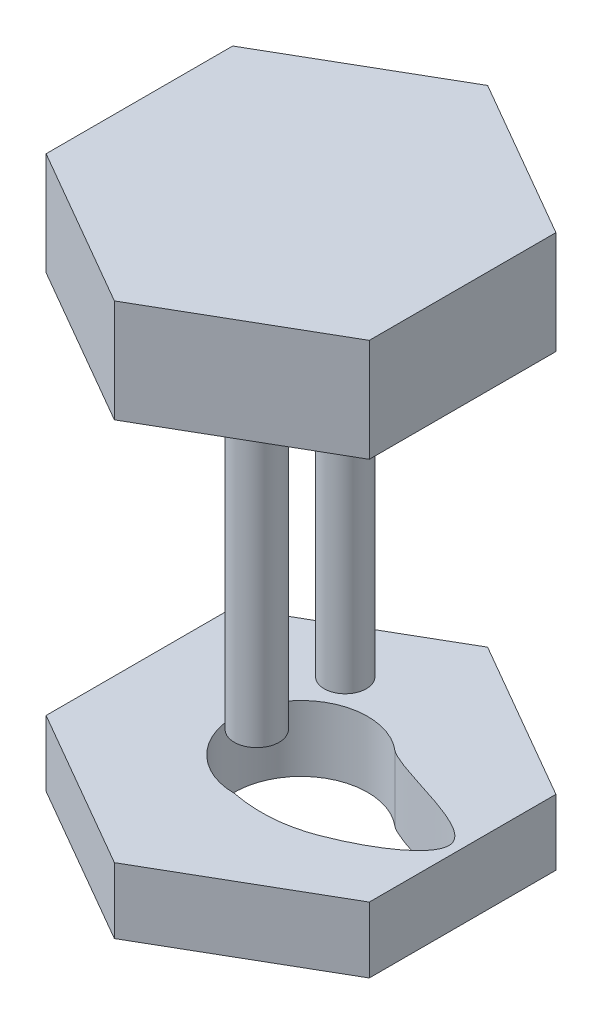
ISO-10303-21;
HEADER;
FILE_DESCRIPTION(('STEP AP214'),'2;1');
FILE_NAME('part.step','',(''),(''),'','','');
FILE_SCHEMA(('AUTOMOTIVE_DESIGN { 1 0 10303 214 1 1 1 1 }'));
ENDSEC;
DATA;
#1=APPLICATION_CONTEXT('core data for automotive mechanical design processes');
#2=APPLICATION_PROTOCOL_DEFINITION('international standard','automotive_design',2000,#1);
#3=PRODUCT_CONTEXT('',#1,'mechanical');
#4=PRODUCT('Part','Part','',(#3));
#5=PRODUCT_RELATED_PRODUCT_CATEGORY('part','',(#4));
#6=PRODUCT_DEFINITION_FORMATION('','',#4);
#7=PRODUCT_DEFINITION_CONTEXT('part definition',#1,'design');
#8=PRODUCT_DEFINITION('design','',#6,#7);
#9=PRODUCT_DEFINITION_SHAPE('','',#8);
#10=(LENGTH_UNIT() NAMED_UNIT(*) SI_UNIT(.MILLI.,.METRE.));
#11=(NAMED_UNIT(*) PLANE_ANGLE_UNIT() SI_UNIT($,.RADIAN.));
#12=(NAMED_UNIT(*) SI_UNIT($,.STERADIAN.) SOLID_ANGLE_UNIT());
#13=UNCERTAINTY_MEASURE_WITH_UNIT(LENGTH_MEASURE(1.E-05),#10,'distance_accuracy_value','');
#14=(GEOMETRIC_REPRESENTATION_CONTEXT(3) GLOBAL_UNCERTAINTY_ASSIGNED_CONTEXT((#13)) GLOBAL_UNIT_ASSIGNED_CONTEXT((#10,
#11,#12)) REPRESENTATION_CONTEXT('',''));
#15=CARTESIAN_POINT('',(0.,0.,0.));
#16=DIRECTION('',(0.,0.,1.));
#17=DIRECTION('',(1.,0.,0.));
#18=AXIS2_PLACEMENT_3D('',#15,#16,#17);
#19=CARTESIAN_POINT('',(0.,-49.5127741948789,0.));
#20=DIRECTION('',(0.,1.,0.));
#21=DIRECTION('',(0.,0.,1.));
#22=AXIS2_PLACEMENT_3D('',#19,#20,#21);
#23=CYLINDRICAL_SURFACE('',#22,7.72601947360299);
#24=CARTESIAN_POINT('',(0.,-41.8927741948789,0.));
#25=DIRECTION('',(0.,-1.,0.));
#26=DIRECTION('',(0.,0.,-1.));
#27=AXIS2_PLACEMENT_3D('',#24,#25,#26);
#28=CIRCLE('',#27,7.72601947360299);
#29=CARTESIAN_POINT('',(0.,-41.8927741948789,7.72601947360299));
#30=VERTEX_POINT('',#29);
#31=CARTESIAN_POINT('',(5.09284425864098,-41.8927741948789,-5.80984632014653));
#32=VERTEX_POINT('',#31);
#33=EDGE_CURVE('E128',#30,#32,#28,.T.);
#34=ORIENTED_EDGE('',*,*,#33,.F.);
#35=DIRECTION('',(0.,1.,0.));
#36=VECTOR('',#35,1.);
#37=CARTESIAN_POINT('',(0.,-49.5127741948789,7.72601947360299));
#38=LINE('',#37,#36);
#39=CARTESIAN_POINT('',(0.,-49.5127741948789,7.72601947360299));
#40=VERTEX_POINT('',#39);
#41=EDGE_CURVE('E12',#40,#30,#38,.T.);
#42=ORIENTED_EDGE('',*,*,#41,.F.);
#43=CARTESIAN_POINT('',(0.,-49.5127741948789,0.));
#44=DIRECTION('',(0.,-1.,0.));
#45=DIRECTION('',(0.,0.,-1.));
#46=AXIS2_PLACEMENT_3D('',#43,#44,#45);
#47=CIRCLE('',#46,7.72601947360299);
#48=CARTESIAN_POINT('',(5.09284425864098,-49.5127741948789,-5.80984632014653));
#49=VERTEX_POINT('',#48);
#50=EDGE_CURVE('E127',#40,#49,#47,.T.);
#51=ORIENTED_EDGE('',*,*,#50,.T.);
#52=DIRECTION('',(0.,1.,0.));
#53=VECTOR('',#52,1.);
#54=CARTESIAN_POINT('',(5.09284425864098,-49.5127741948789,-5.80984632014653));
#55=LINE('',#54,#53);
#56=EDGE_CURVE('E102',#49,#32,#55,.T.);
#57=ORIENTED_EDGE('',*,*,#56,.T.);
#58=EDGE_LOOP('',(#34,#42,#51,#57));
#59=FACE_BOUND('',#58,.T.);
#60=ADVANCED_FACE('F45',(#59),#23,.F.);
#61=CARTESIAN_POINT('',(0.,-49.5127741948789,7.72601947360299));
#62=CARTESIAN_POINT('',(4.85697957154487,-49.5127741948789,8.66761798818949));
#63=CARTESIAN_POINT('',(9.13580661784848,-49.5127741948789,7.03112665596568));
#64=B_SPLINE_CURVE_WITH_KNOTS('',2,(#61,#62,#63),.UNSPECIFIED.,.F.,.F.,(3,3),(0.,1.),.UNSPECIFIED.);
#65=DIRECTION('',(0.,1.,0.));
#66=VECTOR('',#65,1.);
#67=SURFACE_OF_LINEAR_EXTRUSION('',#64,#66);
#68=CARTESIAN_POINT('',(0.,-41.8927741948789,7.72601947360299));
#69=CARTESIAN_POINT('',(4.85697957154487,-41.8927741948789,8.66761798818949));
#70=CARTESIAN_POINT('',(9.13580661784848,-41.8927741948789,7.03112665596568));
#71=B_SPLINE_CURVE_WITH_KNOTS('',2,(#68,#69,#70),.UNSPECIFIED.,.F.,.F.,(3,3),(0.,1.),.UNSPECIFIED.);
#72=CARTESIAN_POINT('',(9.13579404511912,-41.8927741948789,7.03113146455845));
#73=VERTEX_POINT('',#72);
#74=EDGE_CURVE('E209',#30,#73,#71,.T.);
#75=ORIENTED_EDGE('',*,*,#74,.T.);
#76=DIRECTION('',(0.,1.,0.));
#77=VECTOR('',#76,1.);
#78=CARTESIAN_POINT('',(9.13579404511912,-49.5127741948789,7.03113146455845));
#79=LINE('',#78,#77);
#80=CARTESIAN_POINT('',(9.13579404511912,-49.5127741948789,7.03113146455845));
#81=VERTEX_POINT('',#80);
#82=EDGE_CURVE('E55',#81,#73,#79,.T.);
#83=ORIENTED_EDGE('',*,*,#82,.F.);
#84=EDGE_CURVE('E132',#40,#81,#64,.T.);
#85=ORIENTED_EDGE('',*,*,#84,.F.);
#86=ORIENTED_EDGE('',*,*,#41,.T.);
#87=EDGE_LOOP('',(#75,#83,#85,#86));
#88=FACE_BOUND('',#87,.T.);
#89=ADVANCED_FACE('F133',(#88),#67,.F.);
#90=CARTESIAN_POINT('',(18.7269070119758,-49.5127741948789,-44.6416384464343));
#91=DIRECTION('',(-1.,0.,0.));
#92=DIRECTION('',(0.,0.,1.));
#93=AXIS2_PLACEMENT_3D('',#90,#91,#92);
#94=PLANE('',#93);
#95=DIRECTION('',(0.,0.,1.));
#96=VECTOR('',#95,1.);
#97=CARTESIAN_POINT('',(18.7269070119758,-41.8927741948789,-44.6416384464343));
#98=LINE('',#97,#96);
#99=CARTESIAN_POINT('',(18.7269070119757,-41.8927741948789,-10.8119848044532));
#100=VERTEX_POINT('',#99);
#101=CARTESIAN_POINT('',(18.7269070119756,-41.8927741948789,10.8119848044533));
#102=VERTEX_POINT('',#101);
#103=EDGE_CURVE('E191',#100,#102,#98,.T.);
#104=ORIENTED_EDGE('',*,*,#103,.T.);
#105=DIRECTION('',(0.,1.,0.));
#106=VECTOR('',#105,1.);
#107=CARTESIAN_POINT('',(18.7269070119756,-49.5127741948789,10.8119848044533));
#108=LINE('',#107,#106);
#109=CARTESIAN_POINT('',(18.7269070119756,-49.5127741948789,10.8119848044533));
#110=VERTEX_POINT('',#109);
#111=EDGE_CURVE('E49',#110,#102,#108,.T.);
#112=ORIENTED_EDGE('',*,*,#111,.F.);
#113=DIRECTION('',(0.,0.,1.));
#114=VECTOR('',#113,1.);
#115=CARTESIAN_POINT('',(18.7269070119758,-49.5127741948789,-44.6416384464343));
#116=LINE('',#115,#114);
#117=CARTESIAN_POINT('',(18.7269070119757,-49.5127741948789,-10.8119848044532));
#118=VERTEX_POINT('',#117);
#119=EDGE_CURVE('E219',#118,#110,#116,.T.);
#120=ORIENTED_EDGE('',*,*,#119,.F.);
#121=DIRECTION('',(0.,1.,0.));
#122=VECTOR('',#121,1.);
#123=CARTESIAN_POINT('',(18.7269070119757,-49.5127741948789,-10.8119848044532));
#124=LINE('',#123,#122);
#125=EDGE_CURVE('E225',#118,#100,#124,.T.);
#126=ORIENTED_EDGE('',*,*,#125,.T.);
#127=EDGE_LOOP('',(#104,#112,#120,#126));
#128=FACE_BOUND('',#127,.T.);
#129=ADVANCED_FACE('F47',(#128),#94,.F.);
#130=CARTESIAN_POINT('',(28.693849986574,-49.5127741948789,5.05756759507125));
#131=DIRECTION('',(-0.500000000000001,0.,-0.866025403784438));
#132=DIRECTION('',(-0.866025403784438,0.,0.500000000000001));
#133=AXIS2_PLACEMENT_3D('',#130,#131,#132);
#134=PLANE('',#133);
#135=DIRECTION('',(-0.866025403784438,0.,0.500000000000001));
#136=VECTOR('',#135,1.);
#137=CARTESIAN_POINT('',(28.693849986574,-41.8927741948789,5.05756759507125));
#138=LINE('',#137,#136);
#139=CARTESIAN_POINT('',(1.49186218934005E-13,-41.8927741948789,21.6239696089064));
#140=VERTEX_POINT('',#139);
#141=EDGE_CURVE('E181',#102,#140,#138,.T.);
#142=ORIENTED_EDGE('',*,*,#141,.T.);
#143=DIRECTION('',(0.,1.,0.));
#144=VECTOR('',#143,1.);
#145=CARTESIAN_POINT('',(1.49186218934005E-13,-49.5127741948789,21.6239696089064));
#146=LINE('',#145,#144);
#147=CARTESIAN_POINT('',(1.49186218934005E-13,-49.5127741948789,21.6239696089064));
#148=VERTEX_POINT('',#147);
#149=EDGE_CURVE('E183',#148,#140,#146,.T.);
#150=ORIENTED_EDGE('',*,*,#149,.F.);
#151=DIRECTION('',(-0.866025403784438,0.,0.500000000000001));
#152=VECTOR('',#151,1.);
#153=CARTESIAN_POINT('',(28.693849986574,-49.5127741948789,5.05756759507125));
#154=LINE('',#153,#152);
#155=EDGE_CURVE('E110',#110,#148,#154,.T.);
#156=ORIENTED_EDGE('',*,*,#155,.F.);
#157=ORIENTED_EDGE('',*,*,#111,.T.);
#158=EDGE_LOOP('',(#142,#150,#156,#157));
#159=FACE_BOUND('',#158,.T.);
#160=ADVANCED_FACE('F174',(#159),#134,.F.);
#161=CARTESIAN_POINT('',(-28.6938499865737,-49.5127741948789,5.05756759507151));
#162=DIRECTION('',(0.499999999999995,0.,-0.866025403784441));
#163=DIRECTION('',(-0.866025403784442,0.,-0.499999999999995));
#164=AXIS2_PLACEMENT_3D('',#161,#162,#163);
#165=PLANE('',#164);
#166=DIRECTION('',(-0.866025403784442,0.,-0.499999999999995));
#167=VECTOR('',#166,1.);
#168=CARTESIAN_POINT('',(-28.6938499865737,-41.8927741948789,5.05756759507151));
#169=LINE('',#168,#167);
#170=CARTESIAN_POINT('',(-18.7269070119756,-41.8927741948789,10.8119848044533));
#171=VERTEX_POINT('',#170);
#172=EDGE_CURVE('E190',#140,#171,#169,.T.);
#173=ORIENTED_EDGE('',*,*,#172,.T.);
#174=DIRECTION('',(0.,1.,0.));
#175=VECTOR('',#174,1.);
#176=CARTESIAN_POINT('',(-18.7269070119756,-49.5127741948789,10.8119848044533));
#177=LINE('',#176,#175);
#178=CARTESIAN_POINT('',(-18.7269070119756,-49.5127741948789,10.8119848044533));
#179=VERTEX_POINT('',#178);
#180=EDGE_CURVE('E196',#179,#171,#177,.T.);
#181=ORIENTED_EDGE('',*,*,#180,.F.);
#182=DIRECTION('',(-0.866025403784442,0.,-0.499999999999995));
#183=VECTOR('',#182,1.);
#184=CARTESIAN_POINT('',(-28.6938499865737,-49.5127741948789,5.05756759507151));
#185=LINE('',#184,#183);
#186=EDGE_CURVE('E195',#148,#179,#185,.T.);
#187=ORIENTED_EDGE('',*,*,#186,.F.);
#188=ORIENTED_EDGE('',*,*,#149,.T.);
#189=EDGE_LOOP('',(#173,#181,#187,#188));
#190=FACE_BOUND('',#189,.T.);
#191=ADVANCED_FACE('F171',(#190),#165,.F.);
#192=CARTESIAN_POINT('',(-18.7269070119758,-49.5127741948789,-44.6416384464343));
#193=DIRECTION('',(1.,0.,0.));
#194=DIRECTION('',(0.,0.,-1.));
#195=AXIS2_PLACEMENT_3D('',#192,#193,#194);
#196=PLANE('',#195);
#197=DIRECTION('',(0.,0.,-1.));
#198=VECTOR('',#197,1.);
#199=CARTESIAN_POINT('',(-18.7269070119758,-41.8927741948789,-44.6416384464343));
#200=LINE('',#199,#198);
#201=CARTESIAN_POINT('',(-18.7269070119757,-41.8927741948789,-10.8119848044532));
#202=VERTEX_POINT('',#201);
#203=EDGE_CURVE('E200',#171,#202,#200,.T.);
#204=ORIENTED_EDGE('',*,*,#203,.T.);
#205=DIRECTION('',(0.,1.,0.));
#206=VECTOR('',#205,1.);
#207=CARTESIAN_POINT('',(-18.7269070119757,-49.5127741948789,-10.8119848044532));
#208=LINE('',#207,#206);
#209=CARTESIAN_POINT('',(-18.7269070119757,-49.5127741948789,-10.8119848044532));
#210=VERTEX_POINT('',#209);
#211=EDGE_CURVE('E231',#210,#202,#208,.T.);
#212=ORIENTED_EDGE('',*,*,#211,.F.);
#213=DIRECTION('',(0.,0.,-1.));
#214=VECTOR('',#213,1.);
#215=CARTESIAN_POINT('',(-18.7269070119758,-49.5127741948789,-44.6416384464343));
#216=LINE('',#215,#214);
#217=EDGE_CURVE('E236',#179,#210,#216,.T.);
#218=ORIENTED_EDGE('',*,*,#217,.F.);
#219=ORIENTED_EDGE('',*,*,#180,.T.);
#220=EDGE_LOOP('',(#204,#212,#218,#219));
#221=FACE_BOUND('',#220,.T.);
#222=ADVANCED_FACE('F167',(#221),#196,.F.);
#223=CARTESIAN_POINT('',(9.96694297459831,-49.5127741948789,-27.3783868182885));
#224=DIRECTION('',(0.500000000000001,0.,0.866025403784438));
#225=DIRECTION('',(0.866025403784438,0.,-0.500000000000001));
#226=AXIS2_PLACEMENT_3D('',#223,#224,#225);
#227=PLANE('',#226);
#228=DIRECTION('',(0.866025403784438,0.,-0.500000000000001));
#229=VECTOR('',#228,1.);
#230=CARTESIAN_POINT('',(9.96694297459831,-41.8927741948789,-27.3783868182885));
#231=LINE('',#230,#229);
#232=CARTESIAN_POINT('',(0.,-41.8927741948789,-21.6239696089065));
#233=VERTEX_POINT('',#232);
#234=EDGE_CURVE('E202',#202,#233,#231,.T.);
#235=ORIENTED_EDGE('',*,*,#234,.T.);
#236=DIRECTION('',(0.,1.,0.));
#237=VECTOR('',#236,1.);
#238=CARTESIAN_POINT('',(0.,-49.5127741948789,-21.6239696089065));
#239=LINE('',#238,#237);
#240=CARTESIAN_POINT('',(0.,-49.5127741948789,-21.6239696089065));
#241=VERTEX_POINT('',#240);
#242=EDGE_CURVE('E228',#241,#233,#239,.T.);
#243=ORIENTED_EDGE('',*,*,#242,.F.);
#244=DIRECTION('',(0.866025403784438,0.,-0.500000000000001));
#245=VECTOR('',#244,1.);
#246=CARTESIAN_POINT('',(9.96694297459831,-49.5127741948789,-27.3783868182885));
#247=LINE('',#246,#245);
#248=EDGE_CURVE('E138',#210,#241,#247,.T.);
#249=ORIENTED_EDGE('',*,*,#248,.F.);
#250=ORIENTED_EDGE('',*,*,#211,.T.);
#251=EDGE_LOOP('',(#235,#243,#249,#250));
#252=FACE_BOUND('',#251,.T.);
#253=ADVANCED_FACE('F163',(#252),#227,.F.);
#254=CARTESIAN_POINT('',(-9.96694297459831,-49.5127741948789,-27.3783868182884));
#255=DIRECTION('',(-0.500000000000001,0.,0.866025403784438));
#256=DIRECTION('',(0.866025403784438,0.,0.500000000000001));
#257=AXIS2_PLACEMENT_3D('',#254,#255,#256);
#258=PLANE('',#257);
#259=DIRECTION('',(0.866025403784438,0.,0.500000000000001));
#260=VECTOR('',#259,1.);
#261=CARTESIAN_POINT('',(-9.96694297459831,-41.8927741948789,-27.3783868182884));
#262=LINE('',#261,#260);
#263=EDGE_CURVE('E206',#233,#100,#262,.T.);
#264=ORIENTED_EDGE('',*,*,#263,.T.);
#265=ORIENTED_EDGE('',*,*,#125,.F.);
#266=DIRECTION('',(0.866025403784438,0.,0.500000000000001));
#267=VECTOR('',#266,1.);
#268=CARTESIAN_POINT('',(-9.96694297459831,-49.5127741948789,-27.3783868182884));
#269=LINE('',#268,#267);
#270=EDGE_CURVE('E136',#241,#118,#269,.T.);
#271=ORIENTED_EDGE('',*,*,#270,.F.);
#272=ORIENTED_EDGE('',*,*,#242,.T.);
#273=EDGE_LOOP('',(#264,#265,#271,#272));
#274=FACE_BOUND('',#273,.T.);
#275=ADVANCED_FACE('F160',(#274),#258,.F.);
#276=CARTESIAN_POINT('',(9.13579404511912,-49.5127741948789,7.03113146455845));
#277=CARTESIAN_POINT('',(9.13579823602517,-49.5127741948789,7.03112986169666));
#278=CARTESIAN_POINT('',(13.8392547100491,-49.5127741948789,5.23223591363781));
#279=CARTESIAN_POINT('',(24.2679195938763,-49.5127741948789,-1.76584882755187));
#280=CARTESIAN_POINT('',(6.47944621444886,-49.5127741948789,-4.26411190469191));
#281=CARTESIAN_POINT('',(4.69056699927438,-49.5127741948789,-6.13921478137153));
#282=B_SPLINE_CURVE_WITH_KNOTS('',3,(#276,#277,#278,#279,#280,#281),.UNSPECIFIED.,.F.,.F.,(4,1,
1,4),(0.266038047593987,0.266038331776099,0.584975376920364,1.),.UNSPECIFIED.);
#283=DIRECTION('',(0.,1.,0.));
#284=VECTOR('',#283,1.);
#285=SURFACE_OF_LINEAR_EXTRUSION('',#282,#284);
#286=CARTESIAN_POINT('',(9.13579404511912,-41.8927741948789,7.03113146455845));
#287=CARTESIAN_POINT('',(9.13579823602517,-41.8927741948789,7.03112986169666));
#288=CARTESIAN_POINT('',(13.8392547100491,-41.8927741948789,5.23223591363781));
#289=CARTESIAN_POINT('',(24.2679195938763,-41.8927741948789,-1.76584882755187));
#290=CARTESIAN_POINT('',(6.47944621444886,-41.8927741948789,-4.26411190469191));
#291=CARTESIAN_POINT('',(4.69056699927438,-41.8927741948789,-6.13921478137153));
#292=B_SPLINE_CURVE_WITH_KNOTS('',3,(#286,#287,#288,#289,#290,#291),.UNSPECIFIED.,.F.,.F.,(4,1,
1,4),(0.266038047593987,0.266038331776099,0.584975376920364,1.),.UNSPECIFIED.);
#293=EDGE_CURVE('E95',#73,#32,#292,.T.);
#294=ORIENTED_EDGE('',*,*,#293,.T.);
#295=ORIENTED_EDGE('',*,*,#56,.F.);
#296=EDGE_CURVE('E64',#81,#49,#282,.T.);
#297=ORIENTED_EDGE('',*,*,#296,.F.);
#298=ORIENTED_EDGE('',*,*,#82,.T.);
#299=EDGE_LOOP('',(#294,#295,#297,#298));
#300=FACE_BOUND('',#299,.T.);
#301=ADVANCED_FACE('F156',(#300),#285,.F.);
#302=CARTESIAN_POINT('',(0.,-49.5127741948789,-44.6416384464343));
#303=DIRECTION('',(0.,-1.,0.));
#304=DIRECTION('',(0.,0.,-1.));
#305=AXIS2_PLACEMENT_3D('',#302,#303,#304);
#306=PLANE('',#305);
#307=ORIENTED_EDGE('',*,*,#119,.T.);
#308=ORIENTED_EDGE('',*,*,#155,.T.);
#309=ORIENTED_EDGE('',*,*,#186,.T.);
#310=ORIENTED_EDGE('',*,*,#217,.T.);
#311=ORIENTED_EDGE('',*,*,#248,.T.);
#312=ORIENTED_EDGE('',*,*,#270,.T.);
#313=EDGE_LOOP('',(#307,#308,#309,#310,#311,#312));
#314=FACE_BOUND('',#313,.T.);
#315=ORIENTED_EDGE('',*,*,#50,.F.);
#316=ORIENTED_EDGE('',*,*,#84,.T.);
#317=ORIENTED_EDGE('',*,*,#296,.T.);
#318=EDGE_LOOP('',(#315,#316,#317));
#319=FACE_BOUND('',#318,.T.);
#320=ADVANCED_FACE('F135',(#314,#319),#306,.T.);
#321=CARTESIAN_POINT('',(0.,-41.8927741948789,-44.6416384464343));
#322=DIRECTION('',(0.,-1.,0.));
#323=DIRECTION('',(0.,0.,-1.));
#324=AXIS2_PLACEMENT_3D('',#321,#322,#323);
#325=PLANE('',#324);
#326=ORIENTED_EDGE('',*,*,#103,.F.);
#327=ORIENTED_EDGE('',*,*,#263,.F.);
#328=ORIENTED_EDGE('',*,*,#234,.F.);
#329=ORIENTED_EDGE('',*,*,#203,.F.);
#330=ORIENTED_EDGE('',*,*,#172,.F.);
#331=ORIENTED_EDGE('',*,*,#141,.F.);
#332=EDGE_LOOP('',(#326,#327,#328,#329,#330,#331));
#333=FACE_BOUND('',#332,.T.);
#334=ORIENTED_EDGE('',*,*,#33,.T.);
#335=ORIENTED_EDGE('',*,*,#293,.F.);
#336=ORIENTED_EDGE('',*,*,#74,.F.);
#337=EDGE_LOOP('',(#334,#335,#336));
#338=FACE_BOUND('',#337,.T.);
#339=ADVANCED_FACE('F198',(#333,#338),#325,.F.);
#340=CLOSED_SHELL('',(#60,#89,#129,#160,#191,#222,#253,#275,#301,#320,#339));
#341=MANIFOLD_SOLID_BREP('B2',#340);
#342=CARTESIAN_POINT('',(0.,6.60400000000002,0.));
#343=DIRECTION('',(0.,-1.,0.));
#344=DIRECTION('',(0.,0.,-1.));
#345=AXIS2_PLACEMENT_3D('',#342,#343,#344);
#346=PLANE('',#345);
#347=CARTESIAN_POINT('',(5.12771279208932,6.60400000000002,0.));
#348=DIRECTION('',(0.,-1.,0.));
#349=DIRECTION('',(0.,0.,-1.));
#350=AXIS2_PLACEMENT_3D('',#347,#348,#349);
#351=CIRCLE('',#350,2.43696408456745);
#352=CARTESIAN_POINT('',(5.12771279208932,6.60400000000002,-2.43696408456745));
#353=VERTEX_POINT('',#352);
#354=EDGE_CURVE('E452',#353,#353,#351,.T.);
#355=ORIENTED_EDGE('',*,*,#354,.F.);
#356=EDGE_LOOP('',(#355));
#357=FACE_BOUND('',#356,.T.);
#358=CARTESIAN_POINT('',(0.,6.60400000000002,0.));
#359=DIRECTION('',(0.,-1.,0.));
#360=DIRECTION('',(0.,0.,-1.));
#361=AXIS2_PLACEMENT_3D('',#358,#359,#360);
#362=CIRCLE('',#361,11.528213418);
#363=CARTESIAN_POINT('',(0.,6.60400000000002,-11.528213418));
#364=VERTEX_POINT('',#363);
#365=EDGE_CURVE('E448',#364,#364,#362,.T.);
#366=ORIENTED_EDGE('',*,*,#365,.T.);
#367=EDGE_LOOP('',(#366));
#368=FACE_BOUND('',#367,.T.);
#369=CARTESIAN_POINT('',(-5.12771279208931,6.60400000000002,0.));
#370=DIRECTION('',(0.,-1.,0.));
#371=DIRECTION('',(0.,0.,-1.));
#372=AXIS2_PLACEMENT_3D('',#369,#370,#371);
#373=CIRCLE('',#372,2.59830668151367);
#374=CARTESIAN_POINT('',(-5.12771279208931,6.60400000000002,-2.59830668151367));
#375=VERTEX_POINT('',#374);
#376=EDGE_CURVE('E455',#375,#375,#373,.T.);
#377=ORIENTED_EDGE('',*,*,#376,.F.);
#378=EDGE_LOOP('',(#377));
#379=FACE_BOUND('',#378,.T.);
#380=ADVANCED_FACE('F326',(#357,#368,#379),#346,.T.);
#381=CARTESIAN_POINT('',(0.,2.54,-21.6239696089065));
#382=DIRECTION('',(0.,1.,0.));
#383=DIRECTION('',(0.,0.,1.));
#384=AXIS2_PLACEMENT_3D('',#381,#382,#383);
#385=PLANE('',#384);
#386=DIRECTION('',(-0.866025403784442,0.,-0.499999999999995));
#387=VECTOR('',#386,1.);
#388=CARTESIAN_POINT('',(18.7269070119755,2.54,-10.8119848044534));
#389=LINE('',#388,#387);
#390=CARTESIAN_POINT('',(18.7269070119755,2.54,-10.8119848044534));
#391=VERTEX_POINT('',#390);
#392=CARTESIAN_POINT('',(0.,2.54,-21.6239696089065));
#393=VERTEX_POINT('',#392);
#394=EDGE_CURVE('E416',#391,#393,#389,.T.);
#395=ORIENTED_EDGE('',*,*,#394,.F.);
#396=DIRECTION('',(0.,0.,-1.));
#397=VECTOR('',#396,1.);
#398=CARTESIAN_POINT('',(18.7269070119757,2.54,10.8119848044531));
#399=LINE('',#398,#397);
#400=CARTESIAN_POINT('',(18.7269070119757,2.54,10.8119848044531));
#401=VERTEX_POINT('',#400);
#402=EDGE_CURVE('E373',#401,#391,#399,.T.);
#403=ORIENTED_EDGE('',*,*,#402,.F.);
#404=DIRECTION('',(0.866025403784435,0.,-0.500000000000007));
#405=VECTOR('',#404,1.);
#406=CARTESIAN_POINT('',(1.50132010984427E-13,2.54,21.6239696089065));
#407=LINE('',#406,#405);
#408=CARTESIAN_POINT('',(1.50132010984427E-13,2.54,21.6239696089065));
#409=VERTEX_POINT('',#408);
#410=EDGE_CURVE('E425',#409,#401,#407,.T.);
#411=ORIENTED_EDGE('',*,*,#410,.F.);
#412=DIRECTION('',(0.866025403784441,0.,0.499999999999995));
#413=VECTOR('',#412,1.);
#414=CARTESIAN_POINT('',(-18.7269070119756,2.54,10.8119848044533));
#415=LINE('',#414,#413);
#416=CARTESIAN_POINT('',(-18.7269070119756,2.54,10.8119848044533));
#417=VERTEX_POINT('',#416);
#418=EDGE_CURVE('E404',#417,#409,#415,.T.);
#419=ORIENTED_EDGE('',*,*,#418,.F.);
#420=DIRECTION('',(0.,0.,1.));
#421=VECTOR('',#420,1.);
#422=CARTESIAN_POINT('',(-18.7269070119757,2.54,-10.8119848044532));
#423=LINE('',#422,#421);
#424=CARTESIAN_POINT('',(-18.7269070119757,2.54,-10.8119848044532));
#425=VERTEX_POINT('',#424);
#426=EDGE_CURVE('E422',#425,#417,#423,.T.);
#427=ORIENTED_EDGE('',*,*,#426,.F.);
#428=DIRECTION('',(-0.866025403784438,0.,0.500000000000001));
#429=VECTOR('',#428,1.);
#430=CARTESIAN_POINT('',(0.,2.54,-21.6239696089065));
#431=LINE('',#430,#429);
#432=EDGE_CURVE('E419',#393,#425,#431,.T.);
#433=ORIENTED_EDGE('',*,*,#432,.F.);
#434=EDGE_LOOP('',(#395,#403,#411,#419,#427,#433));
#435=FACE_BOUND('',#434,.T.);
#436=CARTESIAN_POINT('',(0.,2.54,0.));
#437=DIRECTION('',(0.,1.,0.));
#438=DIRECTION('',(0.,0.,1.));
#439=AXIS2_PLACEMENT_3D('',#436,#437,#438);
#440=CIRCLE('',#439,11.528213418);
#441=CARTESIAN_POINT('',(0.,2.54,11.528213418));
#442=VERTEX_POINT('',#441);
#443=EDGE_CURVE('E420',#442,#442,#440,.T.);
#444=ORIENTED_EDGE('',*,*,#443,.T.);
#445=EDGE_LOOP('',(#444));
#446=FACE_BOUND('',#445,.T.);
#447=ADVANCED_FACE('F437',(#435,#446),#385,.F.);
#448=CARTESIAN_POINT('',(18.7269070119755,14.478,-10.8119848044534));
#449=DIRECTION('',(-0.499999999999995,0.,0.866025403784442));
#450=DIRECTION('',(0.866025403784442,0.,0.499999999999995));
#451=AXIS2_PLACEMENT_3D('',#448,#449,#450);
#452=PLANE('',#451);
#453=ORIENTED_EDGE('',*,*,#394,.T.);
#454=DIRECTION('',(0.,-1.,0.));
#455=VECTOR('',#454,1.);
#456=CARTESIAN_POINT('',(0.,14.478,-21.6239696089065));
#457=LINE('',#456,#455);
#458=CARTESIAN_POINT('',(0.,14.478,-21.6239696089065));
#459=VERTEX_POINT('',#458);
#460=EDGE_CURVE('E43',#459,#393,#457,.T.);
#461=ORIENTED_EDGE('',*,*,#460,.F.);
#462=DIRECTION('',(-0.866025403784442,0.,-0.499999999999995));
#463=VECTOR('',#462,1.);
#464=CARTESIAN_POINT('',(18.7269070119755,14.478,-10.8119848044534));
#465=LINE('',#464,#463);
#466=CARTESIAN_POINT('',(18.7269070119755,14.478,-10.8119848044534));
#467=VERTEX_POINT('',#466);
#468=EDGE_CURVE('E428',#467,#459,#465,.T.);
#469=ORIENTED_EDGE('',*,*,#468,.F.);
#470=DIRECTION('',(0.,-1.,0.));
#471=VECTOR('',#470,1.);
#472=CARTESIAN_POINT('',(18.7269070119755,14.478,-10.8119848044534));
#473=LINE('',#472,#471);
#474=EDGE_CURVE('E412',#467,#391,#473,.T.);
#475=ORIENTED_EDGE('',*,*,#474,.T.);
#476=EDGE_LOOP('',(#453,#461,#469,#475));
#477=FACE_BOUND('',#476,.T.);
#478=ADVANCED_FACE('F328',(#477),#452,.F.);
#479=CARTESIAN_POINT('',(0.,14.478,-21.6239696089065));
#480=DIRECTION('',(0.500000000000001,0.,0.866025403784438));
#481=DIRECTION('',(0.866025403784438,0.,-0.500000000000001));
#482=AXIS2_PLACEMENT_3D('',#479,#480,#481);
#483=PLANE('',#482);
#484=ORIENTED_EDGE('',*,*,#432,.T.);
#485=DIRECTION('',(0.,-1.,0.));
#486=VECTOR('',#485,1.);
#487=CARTESIAN_POINT('',(-18.7269070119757,14.478,-10.8119848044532));
#488=LINE('',#487,#486);
#489=CARTESIAN_POINT('',(-18.7269070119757,14.478,-10.8119848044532));
#490=VERTEX_POINT('',#489);
#491=EDGE_CURVE('E334',#490,#425,#488,.T.);
#492=ORIENTED_EDGE('',*,*,#491,.F.);
#493=DIRECTION('',(-0.866025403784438,0.,0.500000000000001));
#494=VECTOR('',#493,1.);
#495=CARTESIAN_POINT('',(0.,14.478,-21.6239696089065));
#496=LINE('',#495,#494);
#497=EDGE_CURVE('E381',#459,#490,#496,.T.);
#498=ORIENTED_EDGE('',*,*,#497,.F.);
#499=ORIENTED_EDGE('',*,*,#460,.T.);
#500=EDGE_LOOP('',(#484,#492,#498,#499));
#501=FACE_BOUND('',#500,.T.);
#502=ADVANCED_FACE('F491',(#501),#483,.F.);
#503=CARTESIAN_POINT('',(-18.7269070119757,14.478,-10.8119848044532));
#504=DIRECTION('',(1.,0.,0.));
#505=DIRECTION('',(0.,0.,-1.));
#506=AXIS2_PLACEMENT_3D('',#503,#504,#505);
#507=PLANE('',#506);
#508=ORIENTED_EDGE('',*,*,#426,.T.);
#509=DIRECTION('',(0.,-1.,0.));
#510=VECTOR('',#509,1.);
#511=CARTESIAN_POINT('',(-18.7269070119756,14.478,10.8119848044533));
#512=LINE('',#511,#510);
#513=CARTESIAN_POINT('',(-18.7269070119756,14.478,10.8119848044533));
#514=VERTEX_POINT('',#513);
#515=EDGE_CURVE('E407',#514,#417,#512,.T.);
#516=ORIENTED_EDGE('',*,*,#515,.F.);
#517=DIRECTION('',(0.,0.,1.));
#518=VECTOR('',#517,1.);
#519=CARTESIAN_POINT('',(-18.7269070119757,14.478,-10.8119848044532));
#520=LINE('',#519,#518);
#521=EDGE_CURVE('E395',#490,#514,#520,.T.);
#522=ORIENTED_EDGE('',*,*,#521,.F.);
#523=ORIENTED_EDGE('',*,*,#491,.T.);
#524=EDGE_LOOP('',(#508,#516,#522,#523));
#525=FACE_BOUND('',#524,.T.);
#526=ADVANCED_FACE('F434',(#525),#507,.F.);
#527=CARTESIAN_POINT('',(-18.7269070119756,14.478,10.8119848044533));
#528=DIRECTION('',(0.499999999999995,0.,-0.866025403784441));
#529=DIRECTION('',(-0.866025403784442,0.,-0.499999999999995));
#530=AXIS2_PLACEMENT_3D('',#527,#528,#529);
#531=PLANE('',#530);
#532=ORIENTED_EDGE('',*,*,#418,.T.);
#533=DIRECTION('',(0.,-1.,0.));
#534=VECTOR('',#533,1.);
#535=CARTESIAN_POINT('',(1.50132010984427E-13,14.478,21.6239696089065));
#536=LINE('',#535,#534);
#537=CARTESIAN_POINT('',(1.50132010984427E-13,14.478,21.6239696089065));
#538=VERTEX_POINT('',#537);
#539=EDGE_CURVE('E401',#538,#409,#536,.T.);
#540=ORIENTED_EDGE('',*,*,#539,.F.);
#541=DIRECTION('',(0.866025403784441,0.,0.499999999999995));
#542=VECTOR('',#541,1.);
#543=CARTESIAN_POINT('',(-18.7269070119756,14.478,10.8119848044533));
#544=LINE('',#543,#542);
#545=EDGE_CURVE('E388',#514,#538,#544,.T.);
#546=ORIENTED_EDGE('',*,*,#545,.F.);
#547=ORIENTED_EDGE('',*,*,#515,.T.);
#548=EDGE_LOOP('',(#532,#540,#546,#547));
#549=FACE_BOUND('',#548,.T.);
#550=ADVANCED_FACE('F402',(#549),#531,.F.);
#551=CARTESIAN_POINT('',(1.50132010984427E-13,14.478,21.6239696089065));
#552=DIRECTION('',(-0.500000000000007,0.,-0.866025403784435));
#553=DIRECTION('',(-0.866025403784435,0.,0.500000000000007));
#554=AXIS2_PLACEMENT_3D('',#551,#552,#553);
#555=PLANE('',#554);
#556=ORIENTED_EDGE('',*,*,#410,.T.);
#557=DIRECTION('',(0.,-1.,0.));
#558=VECTOR('',#557,1.);
#559=CARTESIAN_POINT('',(18.7269070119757,14.478,10.8119848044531));
#560=LINE('',#559,#558);
#561=CARTESIAN_POINT('',(18.7269070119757,14.478,10.8119848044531));
#562=VERTEX_POINT('',#561);
#563=EDGE_CURVE('E408',#562,#401,#560,.T.);
#564=ORIENTED_EDGE('',*,*,#563,.F.);
#565=DIRECTION('',(0.866025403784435,0.,-0.500000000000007));
#566=VECTOR('',#565,1.);
#567=CARTESIAN_POINT('',(1.50132010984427E-13,14.478,21.6239696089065));
#568=LINE('',#567,#566);
#569=EDGE_CURVE('E392',#538,#562,#568,.T.);
#570=ORIENTED_EDGE('',*,*,#569,.F.);
#571=ORIENTED_EDGE('',*,*,#539,.T.);
#572=EDGE_LOOP('',(#556,#564,#570,#571));
#573=FACE_BOUND('',#572,.T.);
#574=ADVANCED_FACE('F410',(#573),#555,.F.);
#575=CARTESIAN_POINT('',(18.7269070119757,14.478,10.8119848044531));
#576=DIRECTION('',(-1.,0.,0.));
#577=DIRECTION('',(0.,0.,1.));
#578=AXIS2_PLACEMENT_3D('',#575,#576,#577);
#579=PLANE('',#578);
#580=ORIENTED_EDGE('',*,*,#402,.T.);
#581=ORIENTED_EDGE('',*,*,#474,.F.);
#582=DIRECTION('',(0.,0.,-1.));
#583=VECTOR('',#582,1.);
#584=CARTESIAN_POINT('',(18.7269070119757,14.478,10.8119848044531));
#585=LINE('',#584,#583);
#586=EDGE_CURVE('E347',#562,#467,#585,.T.);
#587=ORIENTED_EDGE('',*,*,#586,.F.);
#588=ORIENTED_EDGE('',*,*,#563,.T.);
#589=EDGE_LOOP('',(#580,#581,#587,#588));
#590=FACE_BOUND('',#589,.T.);
#591=ADVANCED_FACE('F439',(#590),#579,.F.);
#592=CARTESIAN_POINT('',(0.,14.478,-21.6239696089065));
#593=DIRECTION('',(0.,1.,0.));
#594=DIRECTION('',(0.,0.,1.));
#595=AXIS2_PLACEMENT_3D('',#592,#593,#594);
#596=PLANE('',#595);
#597=ORIENTED_EDGE('',*,*,#468,.T.);
#598=ORIENTED_EDGE('',*,*,#497,.T.);
#599=ORIENTED_EDGE('',*,*,#521,.T.);
#600=ORIENTED_EDGE('',*,*,#545,.T.);
#601=ORIENTED_EDGE('',*,*,#569,.T.);
#602=ORIENTED_EDGE('',*,*,#586,.T.);
#603=EDGE_LOOP('',(#597,#598,#599,#600,#601,#602));
#604=FACE_BOUND('',#603,.T.);
#605=ADVANCED_FACE('F390',(#604),#596,.T.);
#606=CARTESIAN_POINT('',(0.,6.60400000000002,0.));
#607=DIRECTION('',(0.,-1.,0.));
#608=DIRECTION('',(0.,0.,-1.));
#609=AXIS2_PLACEMENT_3D('',#606,#607,#608);
#610=CYLINDRICAL_SURFACE('',#609,11.528213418);
#611=ORIENTED_EDGE('',*,*,#365,.F.);
#612=EDGE_LOOP('',(#611));
#613=FACE_BOUND('',#612,.T.);
#614=ORIENTED_EDGE('',*,*,#443,.F.);
#615=EDGE_LOOP('',(#614));
#616=FACE_BOUND('',#615,.T.);
#617=ADVANCED_FACE('F478',(#613,#616),#610,.F.);
#618=CARTESIAN_POINT('',(5.12771279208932,-31.4787741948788,0.));
#619=DIRECTION('',(0.,1.,0.));
#620=DIRECTION('',(0.,0.,1.));
#621=AXIS2_PLACEMENT_3D('',#618,#619,#620);
#622=CYLINDRICAL_SURFACE('',#621,2.43696408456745);
#623=CARTESIAN_POINT('',(5.12771279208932,-31.4787741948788,0.));
#624=DIRECTION('',(0.,-1.,0.));
#625=DIRECTION('',(0.,0.,-1.));
#626=AXIS2_PLACEMENT_3D('',#623,#624,#625);
#627=CIRCLE('',#626,2.43696408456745);
#628=CARTESIAN_POINT('',(5.12771279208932,-31.4787741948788,-2.43696408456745));
#629=VERTEX_POINT('',#628);
#630=EDGE_CURVE('E451',#629,#629,#627,.T.);
#631=ORIENTED_EDGE('',*,*,#630,.F.);
#632=EDGE_LOOP('',(#631));
#633=FACE_BOUND('',#632,.T.);
#634=ORIENTED_EDGE('',*,*,#354,.T.);
#635=EDGE_LOOP('',(#634));
#636=FACE_BOUND('',#635,.T.);
#637=ADVANCED_FACE('F476',(#633,#636),#622,.T.);
#638=CARTESIAN_POINT('',(3.59934679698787,-31.4787741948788,-29.7288770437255));
#639=DIRECTION('',(0.,-1.,0.));
#640=DIRECTION('',(0.,0.,-1.));
#641=AXIS2_PLACEMENT_3D('',#638,#639,#640);
#642=PLANE('',#641);
#643=ORIENTED_EDGE('',*,*,#630,.T.);
#644=EDGE_LOOP('',(#643));
#645=FACE_BOUND('',#644,.T.);
#646=ADVANCED_FACE('F552',(#645),#642,.T.);
#647=CARTESIAN_POINT('',(-5.12771279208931,-31.4787741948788,0.));
#648=DIRECTION('',(0.,1.,0.));
#649=DIRECTION('',(0.,0.,1.));
#650=AXIS2_PLACEMENT_3D('',#647,#648,#649);
#651=CYLINDRICAL_SURFACE('',#650,2.59830668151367);
#652=ORIENTED_EDGE('',*,*,#376,.T.);
#653=EDGE_LOOP('',(#652));
#654=FACE_BOUND('',#653,.T.);
#655=CARTESIAN_POINT('',(-5.12771279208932,-41.8927741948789,0.));
#656=DIRECTION('',(0.,-1.,0.));
#657=DIRECTION('',(0.,0.,-1.));
#658=AXIS2_PLACEMENT_3D('',#655,#656,#657);
#659=CIRCLE('',#658,2.59830668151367);
#660=CARTESIAN_POINT('',(-7.72601947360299,-41.8927741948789,0.));
#661=VERTEX_POINT('',#660);
#662=EDGE_CURVE('E339',#661,#661,#659,.T.);
#663=ORIENTED_EDGE('',*,*,#662,.F.);
#664=EDGE_LOOP('',(#663));
#665=FACE_BOUND('',#664,.T.);
#666=ADVANCED_FACE('F462',(#654,#665),#651,.T.);
#667=CARTESIAN_POINT('',(-5.12771279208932,-41.8927741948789,0.));
#668=DIRECTION('',(0.,-1.,0.));
#669=DIRECTION('',(0.,0.,-1.));
#670=AXIS2_PLACEMENT_3D('',#667,#668,#669);
#671=PLANE('',#670);
#672=ORIENTED_EDGE('',*,*,#662,.T.);
#673=EDGE_LOOP('',(#672));
#674=FACE_BOUND('',#673,.T.);
#675=ADVANCED_FACE('F566',(#674),#671,.T.);
#676=CLOSED_SHELL('',(#380,#447,#478,#502,#526,#550,#574,#591,#605,#617,#637,#646,#666,#675));
#677=MANIFOLD_SOLID_BREP('B6',#676);
#678=ADVANCED_BREP_SHAPE_REPRESENTATION('',(#18,#341,#677),#14);
#679=SHAPE_DEFINITION_REPRESENTATION(#9,#678);
ENDSEC;
END-ISO-10303-21;
